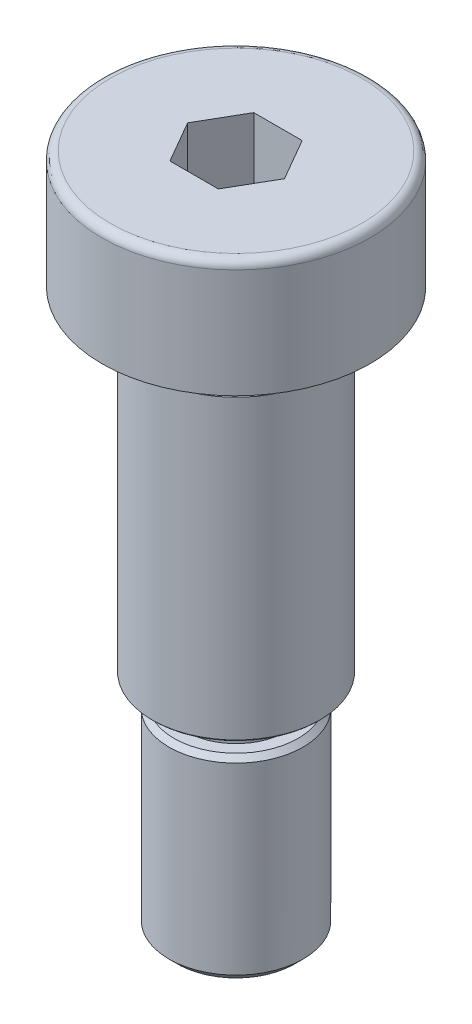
ISO-10303-21;
HEADER;
FILE_DESCRIPTION(('STEP AP214'),'2;1');
FILE_NAME('part.step','',(''),(''),'','','');
FILE_SCHEMA(('AUTOMOTIVE_DESIGN { 1 0 10303 214 1 1 1 1 }'));
ENDSEC;
DATA;
#1=APPLICATION_CONTEXT('core data for automotive mechanical design processes');
#2=APPLICATION_PROTOCOL_DEFINITION('international standard','automotive_design',2000,#1);
#3=PRODUCT_CONTEXT('',#1,'mechanical');
#4=PRODUCT('Part','Part','',(#3));
#5=PRODUCT_RELATED_PRODUCT_CATEGORY('part','',(#4));
#6=PRODUCT_DEFINITION_FORMATION('','',#4);
#7=PRODUCT_DEFINITION_CONTEXT('part definition',#1,'design');
#8=PRODUCT_DEFINITION('design','',#6,#7);
#9=PRODUCT_DEFINITION_SHAPE('','',#8);
#10=(LENGTH_UNIT() NAMED_UNIT(*) SI_UNIT(.MILLI.,.METRE.));
#11=(NAMED_UNIT(*) PLANE_ANGLE_UNIT() SI_UNIT($,.RADIAN.));
#12=(NAMED_UNIT(*) SI_UNIT($,.STERADIAN.) SOLID_ANGLE_UNIT());
#13=UNCERTAINTY_MEASURE_WITH_UNIT(LENGTH_MEASURE(1.E-05),#10,'distance_accuracy_value','');
#14=(GEOMETRIC_REPRESENTATION_CONTEXT(3) GLOBAL_UNCERTAINTY_ASSIGNED_CONTEXT((#13)) GLOBAL_UNIT_ASSIGNED_CONTEXT((#10,
#11,#12)) REPRESENTATION_CONTEXT('',''));
#15=CARTESIAN_POINT('',(0.,0.,0.));
#16=DIRECTION('',(0.,0.,1.));
#17=DIRECTION('',(1.,0.,0.));
#18=AXIS2_PLACEMENT_3D('',#15,#16,#17);
#19=CARTESIAN_POINT('',(-4.00000000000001,0.,0.));
#20=DIRECTION('',(0.,-1.,0.));
#21=DIRECTION('',(0.,0.,-1.));
#22=AXIS2_PLACEMENT_3D('',#19,#20,#21);
#23=PLANE('',#22);
#24=CARTESIAN_POINT('',(0.,0.,0.));
#25=DIRECTION('',(0.,-1.,0.));
#26=DIRECTION('',(0.,0.,-1.));
#27=AXIS2_PLACEMENT_3D('',#24,#25,#26);
#28=CIRCLE('',#27,3.5);
#29=CARTESIAN_POINT('',(0.,0.,-3.5));
#30=VERTEX_POINT('',#29);
#31=EDGE_CURVE('E178',#30,#30,#28,.T.);
#32=ORIENTED_EDGE('',*,*,#31,.T.);
#33=EDGE_LOOP('',(#32));
#34=FACE_BOUND('',#33,.T.);
#35=ADVANCED_FACE('F28',(#34),#23,.T.);
#36=CARTESIAN_POINT('',(0.,50.,0.));
#37=DIRECTION('',(0.,1.,0.));
#38=DIRECTION('',(0.,0.,1.));
#39=AXIS2_PLACEMENT_3D('',#36,#37,#38);
#40=CYLINDRICAL_SURFACE('',#39,4.);
#41=CARTESIAN_POINT('',(0.,11.45,0.));
#42=DIRECTION('',(0.,1.,0.));
#43=DIRECTION('',(0.,0.,1.));
#44=AXIS2_PLACEMENT_3D('',#41,#42,#43);
#45=CIRCLE('',#44,4.);
#46=CARTESIAN_POINT('',(0.,11.45,4.));
#47=VERTEX_POINT('',#46);
#48=EDGE_CURVE('E11',#47,#47,#45,.F.);
#49=ORIENTED_EDGE('',*,*,#48,.T.);
#50=EDGE_LOOP('',(#49));
#51=FACE_BOUND('',#50,.T.);
#52=CARTESIAN_POINT('',(0.,0.500000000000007,0.));
#53=DIRECTION('',(0.,-1.,0.));
#54=DIRECTION('',(0.,0.,-1.));
#55=AXIS2_PLACEMENT_3D('',#52,#53,#54);
#56=CIRCLE('',#55,4.);
#57=CARTESIAN_POINT('',(0.,0.500000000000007,-4.));
#58=VERTEX_POINT('',#57);
#59=EDGE_CURVE('E175',#58,#58,#56,.F.);
#60=ORIENTED_EDGE('',*,*,#59,.T.);
#61=EDGE_LOOP('',(#60));
#62=FACE_BOUND('',#61,.T.);
#63=ADVANCED_FACE('F199',(#51,#62),#40,.T.);
#64=CARTESIAN_POINT('',(-3.,11.75,0.));
#65=DIRECTION('',(0.,1.,0.));
#66=DIRECTION('',(0.,0.,1.));
#67=AXIS2_PLACEMENT_3D('',#64,#65,#66);
#68=PLANE('',#67);
#69=CARTESIAN_POINT('',(0.,11.75,0.));
#70=DIRECTION('',(0.,1.,0.));
#71=DIRECTION('',(0.,0.,1.));
#72=AXIS2_PLACEMENT_3D('',#69,#70,#71);
#73=CIRCLE('',#72,3.69999999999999);
#74=CARTESIAN_POINT('',(0.,11.75,3.69999999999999));
#75=VERTEX_POINT('',#74);
#76=EDGE_CURVE('E35',#75,#75,#73,.T.);
#77=ORIENTED_EDGE('',*,*,#76,.T.);
#78=EDGE_LOOP('',(#77));
#79=FACE_BOUND('',#78,.T.);
#80=CARTESIAN_POINT('',(0.,11.75,0.));
#81=DIRECTION('',(0.,1.,0.));
#82=DIRECTION('',(0.,0.,1.));
#83=AXIS2_PLACEMENT_3D('',#80,#81,#82);
#84=CIRCLE('',#83,3.);
#85=CARTESIAN_POINT('',(0.,11.75,3.));
#86=VERTEX_POINT('',#85);
#87=EDGE_CURVE('E148',#86,#86,#84,.T.);
#88=ORIENTED_EDGE('',*,*,#87,.F.);
#89=EDGE_LOOP('',(#88));
#90=FACE_BOUND('',#89,.T.);
#91=ADVANCED_FACE('F183',(#79,#90),#68,.T.);
#92=CARTESIAN_POINT('',(0.,50.,0.));
#93=DIRECTION('',(0.,1.,0.));
#94=DIRECTION('',(0.,0.,1.));
#95=AXIS2_PLACEMENT_3D('',#92,#93,#94);
#96=CYLINDRICAL_SURFACE('',#95,3.);
#97=CARTESIAN_POINT('',(0.,13.05,0.));
#98=DIRECTION('',(0.,-1.,0.));
#99=DIRECTION('',(0.,0.,-1.));
#100=AXIS2_PLACEMENT_3D('',#97,#98,#99);
#101=CIRCLE('',#100,3.);
#102=CARTESIAN_POINT('',(0.,13.05,-3.));
#103=VERTEX_POINT('',#102);
#104=EDGE_CURVE('E172',#103,#103,#101,.T.);
#105=ORIENTED_EDGE('',*,*,#104,.T.);
#106=EDGE_LOOP('',(#105));
#107=FACE_BOUND('',#106,.T.);
#108=ORIENTED_EDGE('',*,*,#87,.T.);
#109=EDGE_LOOP('',(#108));
#110=FACE_BOUND('',#109,.T.);
#111=ADVANCED_FACE('F212',(#107,#110),#96,.T.);
#112=CARTESIAN_POINT('',(-5.,13.25,0.));
#113=DIRECTION('',(0.,-1.,0.));
#114=DIRECTION('',(0.,0.,-1.));
#115=AXIS2_PLACEMENT_3D('',#112,#113,#114);
#116=PLANE('',#115);
#117=CARTESIAN_POINT('',(0.,13.25,0.));
#118=DIRECTION('',(0.,-1.,0.));
#119=DIRECTION('',(0.,0.,-1.));
#120=AXIS2_PLACEMENT_3D('',#117,#118,#119);
#121=CIRCLE('',#120,3.2);
#122=CARTESIAN_POINT('',(0.,13.25,-3.2));
#123=VERTEX_POINT('',#122);
#124=EDGE_CURVE('E169',#123,#123,#121,.F.);
#125=ORIENTED_EDGE('',*,*,#124,.T.);
#126=EDGE_LOOP('',(#125));
#127=FACE_BOUND('',#126,.T.);
#128=CARTESIAN_POINT('',(0.,13.25,0.));
#129=DIRECTION('',(0.,-1.,0.));
#130=DIRECTION('',(0.,0.,-1.));
#131=AXIS2_PLACEMENT_3D('',#128,#129,#130);
#132=CIRCLE('',#131,4.9);
#133=CARTESIAN_POINT('',(0.,13.25,-4.9));
#134=VERTEX_POINT('',#133);
#135=EDGE_CURVE('E166',#134,#134,#132,.T.);
#136=ORIENTED_EDGE('',*,*,#135,.T.);
#137=EDGE_LOOP('',(#136));
#138=FACE_BOUND('',#137,.T.);
#139=ADVANCED_FACE('F217',(#127,#138),#116,.T.);
#140=CARTESIAN_POINT('',(0.,50.,0.));
#141=DIRECTION('',(0.,1.,0.));
#142=DIRECTION('',(0.,0.,1.));
#143=AXIS2_PLACEMENT_3D('',#140,#141,#142);
#144=CYLINDRICAL_SURFACE('',#143,5.);
#145=CARTESIAN_POINT('',(0.,13.35,0.));
#146=DIRECTION('',(0.,-1.,0.));
#147=DIRECTION('',(0.,0.,-1.));
#148=AXIS2_PLACEMENT_3D('',#145,#146,#147);
#149=CIRCLE('',#148,5.);
#150=CARTESIAN_POINT('',(0.,13.35,-5.));
#151=VERTEX_POINT('',#150);
#152=EDGE_CURVE('E163',#151,#151,#149,.F.);
#153=ORIENTED_EDGE('',*,*,#152,.T.);
#154=EDGE_LOOP('',(#153));
#155=FACE_BOUND('',#154,.T.);
#156=CARTESIAN_POINT('',(0.,31.05,0.));
#157=DIRECTION('',(0.,1.,0.));
#158=DIRECTION('',(0.,0.,1.));
#159=AXIS2_PLACEMENT_3D('',#156,#157,#158);
#160=CIRCLE('',#159,5.);
#161=CARTESIAN_POINT('',(0.,31.05,5.));
#162=VERTEX_POINT('',#161);
#163=EDGE_CURVE('E154',#162,#162,#160,.F.);
#164=ORIENTED_EDGE('',*,*,#163,.T.);
#165=EDGE_LOOP('',(#164));
#166=FACE_BOUND('',#165,.T.);
#167=ADVANCED_FACE('F221',(#155,#166),#144,.T.);
#168=CARTESIAN_POINT('',(-4.,31.25,0.));
#169=DIRECTION('',(0.,1.,0.));
#170=DIRECTION('',(0.,0.,1.));
#171=AXIS2_PLACEMENT_3D('',#168,#169,#170);
#172=PLANE('',#171);
#173=CARTESIAN_POINT('',(0.,31.25,0.));
#174=DIRECTION('',(0.,1.,0.));
#175=DIRECTION('',(0.,0.,1.));
#176=AXIS2_PLACEMENT_3D('',#173,#174,#175);
#177=CIRCLE('',#176,4.8);
#178=CARTESIAN_POINT('',(0.,31.25,4.8));
#179=VERTEX_POINT('',#178);
#180=EDGE_CURVE('E151',#179,#179,#177,.T.);
#181=ORIENTED_EDGE('',*,*,#180,.T.);
#182=EDGE_LOOP('',(#181));
#183=FACE_BOUND('',#182,.T.);
#184=CARTESIAN_POINT('',(0.,31.25,0.));
#185=DIRECTION('',(0.,1.,0.));
#186=DIRECTION('',(0.,0.,1.));
#187=AXIS2_PLACEMENT_3D('',#184,#185,#186);
#188=CIRCLE('',#187,4.);
#189=CARTESIAN_POINT('',(0.,31.25,4.));
#190=VERTEX_POINT('',#189);
#191=EDGE_CURVE('E145',#190,#190,#188,.T.);
#192=ORIENTED_EDGE('',*,*,#191,.F.);
#193=EDGE_LOOP('',(#192));
#194=FACE_BOUND('',#193,.T.);
#195=ADVANCED_FACE('F225',(#183,#194),#172,.T.);
#196=CARTESIAN_POINT('',(0.,50.,0.));
#197=DIRECTION('',(0.,1.,0.));
#198=DIRECTION('',(0.,0.,1.));
#199=AXIS2_PLACEMENT_3D('',#196,#197,#198);
#200=CYLINDRICAL_SURFACE('',#199,4.);
#201=CARTESIAN_POINT('',(0.,33.15,0.));
#202=DIRECTION('',(0.,-1.,0.));
#203=DIRECTION('',(0.,0.,-1.));
#204=AXIS2_PLACEMENT_3D('',#201,#202,#203);
#205=CIRCLE('',#204,4.);
#206=CARTESIAN_POINT('',(0.,33.15,-4.));
#207=VERTEX_POINT('',#206);
#208=EDGE_CURVE('E160',#207,#207,#205,.T.);
#209=ORIENTED_EDGE('',*,*,#208,.T.);
#210=EDGE_LOOP('',(#209));
#211=FACE_BOUND('',#210,.T.);
#212=ORIENTED_EDGE('',*,*,#191,.T.);
#213=EDGE_LOOP('',(#212));
#214=FACE_BOUND('',#213,.T.);
#215=ADVANCED_FACE('F229',(#211,#214),#200,.T.);
#216=CARTESIAN_POINT('',(-8.,33.25,0.));
#217=DIRECTION('',(0.,-1.,0.));
#218=DIRECTION('',(0.,0.,-1.));
#219=AXIS2_PLACEMENT_3D('',#216,#217,#218);
#220=PLANE('',#219);
#221=CARTESIAN_POINT('',(0.,33.25,0.));
#222=DIRECTION('',(0.,-1.,0.));
#223=DIRECTION('',(0.,0.,-1.));
#224=AXIS2_PLACEMENT_3D('',#221,#222,#223);
#225=CIRCLE('',#224,4.1);
#226=CARTESIAN_POINT('',(0.,33.25,-4.1));
#227=VERTEX_POINT('',#226);
#228=EDGE_CURVE('E157',#227,#227,#225,.F.);
#229=ORIENTED_EDGE('',*,*,#228,.T.);
#230=EDGE_LOOP('',(#229));
#231=FACE_BOUND('',#230,.T.);
#232=CARTESIAN_POINT('',(0.,33.25,0.));
#233=DIRECTION('',(0.,1.,0.));
#234=DIRECTION('',(0.,0.,1.));
#235=AXIS2_PLACEMENT_3D('',#232,#233,#234);
#236=CIRCLE('',#235,8.);
#237=CARTESIAN_POINT('',(0.,33.25,8.));
#238=VERTEX_POINT('',#237);
#239=EDGE_CURVE('E142',#238,#238,#236,.T.);
#240=ORIENTED_EDGE('',*,*,#239,.F.);
#241=EDGE_LOOP('',(#240));
#242=FACE_BOUND('',#241,.T.);
#243=ADVANCED_FACE('F233',(#231,#242),#220,.T.);
#244=CARTESIAN_POINT('',(0.,50.,0.));
#245=DIRECTION('',(0.,1.,0.));
#246=DIRECTION('',(0.,0.,1.));
#247=AXIS2_PLACEMENT_3D('',#244,#245,#246);
#248=CYLINDRICAL_SURFACE('',#247,8.);
#249=ORIENTED_EDGE('',*,*,#239,.T.);
#250=EDGE_LOOP('',(#249));
#251=FACE_BOUND('',#250,.T.);
#252=CARTESIAN_POINT('',(0.,39.75,0.));
#253=DIRECTION('',(0.,1.,0.));
#254=DIRECTION('',(0.,0.,1.));
#255=AXIS2_PLACEMENT_3D('',#252,#253,#254);
#256=CIRCLE('',#255,8.);
#257=CARTESIAN_POINT('',(0.,39.75,8.));
#258=VERTEX_POINT('',#257);
#259=EDGE_CURVE('E139',#258,#258,#256,.T.);
#260=ORIENTED_EDGE('',*,*,#259,.F.);
#261=EDGE_LOOP('',(#260));
#262=FACE_BOUND('',#261,.T.);
#263=ADVANCED_FACE('F237',(#251,#262),#248,.T.);
#264=CARTESIAN_POINT('',(0.,39.75,0.));
#265=DIRECTION('',(0.,1.,0.));
#266=DIRECTION('',(0.,0.,1.));
#267=AXIS2_PLACEMENT_3D('',#264,#265,#266);
#268=TOROIDAL_SURFACE('',#267,7.5,0.5);
#269=CARTESIAN_POINT('',(0.,40.25,0.));
#270=DIRECTION('',(0.,1.,0.));
#271=DIRECTION('',(0.,0.,1.));
#272=AXIS2_PLACEMENT_3D('',#269,#270,#271);
#273=CIRCLE('',#272,7.5);
#274=CARTESIAN_POINT('',(0.,40.25,7.5));
#275=VERTEX_POINT('',#274);
#276=EDGE_CURVE('E130',#275,#275,#273,.T.);
#277=ORIENTED_EDGE('',*,*,#276,.F.);
#278=EDGE_LOOP('',(#277));
#279=FACE_BOUND('',#278,.T.);
#280=ORIENTED_EDGE('',*,*,#259,.T.);
#281=EDGE_LOOP('',(#280));
#282=FACE_BOUND('',#281,.T.);
#283=ADVANCED_FACE('F241',(#279,#282),#268,.T.);
#284=CARTESIAN_POINT('',(0.,40.25,0.));
#285=DIRECTION('',(0.,1.,0.));
#286=DIRECTION('',(0.,0.,1.));
#287=AXIS2_PLACEMENT_3D('',#284,#285,#286);
#288=PLANE('',#287);
#289=DIRECTION('',(-0.5,0.,0.866025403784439));
#290=VECTOR('',#289,1.);
#291=CARTESIAN_POINT('',(-1.44337567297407,40.25,-2.5));
#292=LINE('',#291,#290);
#293=CARTESIAN_POINT('',(-1.44337567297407,40.25,-2.5));
#294=VERTEX_POINT('',#293);
#295=CARTESIAN_POINT('',(-2.88675134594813,40.25,0.));
#296=VERTEX_POINT('',#295);
#297=EDGE_CURVE('E42',#294,#296,#292,.T.);
#298=ORIENTED_EDGE('',*,*,#297,.F.);
#299=DIRECTION('',(-1.,0.,0.));
#300=VECTOR('',#299,1.);
#301=CARTESIAN_POINT('',(1.44337567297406,40.25,-2.5));
#302=LINE('',#301,#300);
#303=CARTESIAN_POINT('',(1.44337567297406,40.25,-2.5));
#304=VERTEX_POINT('',#303);
#305=EDGE_CURVE('E112',#304,#294,#302,.T.);
#306=ORIENTED_EDGE('',*,*,#305,.F.);
#307=DIRECTION('',(-0.5,0.,-0.866025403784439));
#308=VECTOR('',#307,1.);
#309=CARTESIAN_POINT('',(2.88675134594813,40.25,0.));
#310=LINE('',#309,#308);
#311=CARTESIAN_POINT('',(2.88675134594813,40.25,0.));
#312=VERTEX_POINT('',#311);
#313=EDGE_CURVE('E106',#312,#304,#310,.T.);
#314=ORIENTED_EDGE('',*,*,#313,.F.);
#315=DIRECTION('',(0.5,0.,-0.866025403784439));
#316=VECTOR('',#315,1.);
#317=CARTESIAN_POINT('',(1.44337567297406,40.25,2.5));
#318=LINE('',#317,#316);
#319=CARTESIAN_POINT('',(1.44337567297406,40.25,2.5));
#320=VERTEX_POINT('',#319);
#321=EDGE_CURVE('E104',#320,#312,#318,.T.);
#322=ORIENTED_EDGE('',*,*,#321,.F.);
#323=DIRECTION('',(1.,0.,0.));
#324=VECTOR('',#323,1.);
#325=CARTESIAN_POINT('',(-1.44337567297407,40.25,2.5));
#326=LINE('',#325,#324);
#327=CARTESIAN_POINT('',(-1.44337567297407,40.25,2.5));
#328=VERTEX_POINT('',#327);
#329=EDGE_CURVE('E85',#328,#320,#326,.T.);
#330=ORIENTED_EDGE('',*,*,#329,.F.);
#331=DIRECTION('',(0.5,0.,0.866025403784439));
#332=VECTOR('',#331,1.);
#333=CARTESIAN_POINT('',(-2.88675134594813,40.25,0.));
#334=LINE('',#333,#332);
#335=EDGE_CURVE('E96',#296,#328,#334,.T.);
#336=ORIENTED_EDGE('',*,*,#335,.F.);
#337=EDGE_LOOP('',(#298,#306,#314,#322,#330,#336));
#338=FACE_BOUND('',#337,.T.);
#339=ORIENTED_EDGE('',*,*,#276,.T.);
#340=EDGE_LOOP('',(#339));
#341=FACE_BOUND('',#340,.T.);
#342=ADVANCED_FACE('F100',(#338,#341),#288,.T.);
#343=CARTESIAN_POINT('',(-1.44337567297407,35.25,-2.5));
#344=DIRECTION('',(-0.866025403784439,0.,-0.5));
#345=DIRECTION('',(-0.5,0.,0.866025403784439));
#346=AXIS2_PLACEMENT_3D('',#343,#344,#345);
#347=PLANE('',#346);
#348=ORIENTED_EDGE('',*,*,#297,.T.);
#349=DIRECTION('',(0.,1.,0.));
#350=VECTOR('',#349,1.);
#351=CARTESIAN_POINT('',(-2.88675134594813,35.25,0.));
#352=LINE('',#351,#350);
#353=CARTESIAN_POINT('',(-2.88675134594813,35.25,0.));
#354=VERTEX_POINT('',#353);
#355=EDGE_CURVE('E93',#354,#296,#352,.T.);
#356=ORIENTED_EDGE('',*,*,#355,.F.);
#357=DIRECTION('',(-0.5,0.,0.866025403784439));
#358=VECTOR('',#357,1.);
#359=CARTESIAN_POINT('',(-1.44337567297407,35.25,-2.5));
#360=LINE('',#359,#358);
#361=CARTESIAN_POINT('',(-1.44337567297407,35.25,-2.5));
#362=VERTEX_POINT('',#361);
#363=EDGE_CURVE('E114',#362,#354,#360,.T.);
#364=ORIENTED_EDGE('',*,*,#363,.F.);
#365=DIRECTION('',(0.,1.,0.));
#366=VECTOR('',#365,1.);
#367=CARTESIAN_POINT('',(-1.44337567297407,35.25,-2.5));
#368=LINE('',#367,#366);
#369=EDGE_CURVE('E49',#362,#294,#368,.T.);
#370=ORIENTED_EDGE('',*,*,#369,.T.);
#371=EDGE_LOOP('',(#348,#356,#364,#370));
#372=FACE_BOUND('',#371,.T.);
#373=ADVANCED_FACE('F248',(#372),#347,.F.);
#374=CARTESIAN_POINT('',(1.44337567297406,35.25,-2.5));
#375=DIRECTION('',(0.,0.,-1.));
#376=DIRECTION('',(-1.,0.,0.));
#377=AXIS2_PLACEMENT_3D('',#374,#375,#376);
#378=PLANE('',#377);
#379=ORIENTED_EDGE('',*,*,#305,.T.);
#380=ORIENTED_EDGE('',*,*,#369,.F.);
#381=DIRECTION('',(-1.,0.,0.));
#382=VECTOR('',#381,1.);
#383=CARTESIAN_POINT('',(1.44337567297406,35.25,-2.5));
#384=LINE('',#383,#382);
#385=CARTESIAN_POINT('',(1.44337567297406,35.25,-2.5));
#386=VERTEX_POINT('',#385);
#387=EDGE_CURVE('E126',#386,#362,#384,.T.);
#388=ORIENTED_EDGE('',*,*,#387,.F.);
#389=DIRECTION('',(0.,1.,0.));
#390=VECTOR('',#389,1.);
#391=CARTESIAN_POINT('',(1.44337567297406,35.25,-2.5));
#392=LINE('',#391,#390);
#393=EDGE_CURVE('E131',#386,#304,#392,.T.);
#394=ORIENTED_EDGE('',*,*,#393,.T.);
#395=EDGE_LOOP('',(#379,#380,#388,#394));
#396=FACE_BOUND('',#395,.T.);
#397=ADVANCED_FACE('F251',(#396),#378,.F.);
#398=CARTESIAN_POINT('',(2.88675134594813,35.25,0.));
#399=DIRECTION('',(0.866025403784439,0.,-0.5));
#400=DIRECTION('',(-0.5,0.,-0.866025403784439));
#401=AXIS2_PLACEMENT_3D('',#398,#399,#400);
#402=PLANE('',#401);
#403=ORIENTED_EDGE('',*,*,#313,.T.);
#404=ORIENTED_EDGE('',*,*,#393,.F.);
#405=DIRECTION('',(-0.5,0.,-0.866025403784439));
#406=VECTOR('',#405,1.);
#407=CARTESIAN_POINT('',(2.88675134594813,35.25,0.));
#408=LINE('',#407,#406);
#409=CARTESIAN_POINT('',(2.88675134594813,35.25,0.));
#410=VERTEX_POINT('',#409);
#411=EDGE_CURVE('E123',#410,#386,#408,.T.);
#412=ORIENTED_EDGE('',*,*,#411,.F.);
#413=DIRECTION('',(0.,1.,0.));
#414=VECTOR('',#413,1.);
#415=CARTESIAN_POINT('',(2.88675134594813,35.25,0.));
#416=LINE('',#415,#414);
#417=EDGE_CURVE('E133',#410,#312,#416,.T.);
#418=ORIENTED_EDGE('',*,*,#417,.T.);
#419=EDGE_LOOP('',(#403,#404,#412,#418));
#420=FACE_BOUND('',#419,.T.);
#421=ADVANCED_FACE('F260',(#420),#402,.F.);
#422=CARTESIAN_POINT('',(1.44337567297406,35.25,2.5));
#423=DIRECTION('',(0.866025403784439,0.,0.5));
#424=DIRECTION('',(0.5,0.,-0.866025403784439));
#425=AXIS2_PLACEMENT_3D('',#422,#423,#424);
#426=PLANE('',#425);
#427=ORIENTED_EDGE('',*,*,#321,.T.);
#428=ORIENTED_EDGE('',*,*,#417,.F.);
#429=DIRECTION('',(0.5,0.,-0.866025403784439));
#430=VECTOR('',#429,1.);
#431=CARTESIAN_POINT('',(1.44337567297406,35.25,2.5));
#432=LINE('',#431,#430);
#433=CARTESIAN_POINT('',(1.44337567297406,35.25,2.5));
#434=VERTEX_POINT('',#433);
#435=EDGE_CURVE('E120',#434,#410,#432,.T.);
#436=ORIENTED_EDGE('',*,*,#435,.F.);
#437=DIRECTION('',(0.,1.,0.));
#438=VECTOR('',#437,1.);
#439=CARTESIAN_POINT('',(1.44337567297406,35.25,2.5));
#440=LINE('',#439,#438);
#441=EDGE_CURVE('E92',#434,#320,#440,.T.);
#442=ORIENTED_EDGE('',*,*,#441,.T.);
#443=EDGE_LOOP('',(#427,#428,#436,#442));
#444=FACE_BOUND('',#443,.T.);
#445=ADVANCED_FACE('F257',(#444),#426,.F.);
#446=CARTESIAN_POINT('',(-1.44337567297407,35.25,2.5));
#447=DIRECTION('',(0.,0.,1.));
#448=DIRECTION('',(1.,0.,0.));
#449=AXIS2_PLACEMENT_3D('',#446,#447,#448);
#450=PLANE('',#449);
#451=ORIENTED_EDGE('',*,*,#329,.T.);
#452=ORIENTED_EDGE('',*,*,#441,.F.);
#453=DIRECTION('',(1.,0.,0.));
#454=VECTOR('',#453,1.);
#455=CARTESIAN_POINT('',(-1.44337567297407,35.25,2.5));
#456=LINE('',#455,#454);
#457=CARTESIAN_POINT('',(-1.44337567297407,35.25,2.5));
#458=VERTEX_POINT('',#457);
#459=EDGE_CURVE('E88',#458,#434,#456,.T.);
#460=ORIENTED_EDGE('',*,*,#459,.F.);
#461=DIRECTION('',(0.,1.,0.));
#462=VECTOR('',#461,1.);
#463=CARTESIAN_POINT('',(-1.44337567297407,35.25,2.5));
#464=LINE('',#463,#462);
#465=EDGE_CURVE('E81',#458,#328,#464,.T.);
#466=ORIENTED_EDGE('',*,*,#465,.T.);
#467=EDGE_LOOP('',(#451,#452,#460,#466));
#468=FACE_BOUND('',#467,.T.);
#469=ADVANCED_FACE('F83',(#468),#450,.F.);
#470=CARTESIAN_POINT('',(-2.88675134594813,35.25,0.));
#471=DIRECTION('',(-0.866025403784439,0.,0.5));
#472=DIRECTION('',(0.5,0.,0.866025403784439));
#473=AXIS2_PLACEMENT_3D('',#470,#471,#472);
#474=PLANE('',#473);
#475=ORIENTED_EDGE('',*,*,#335,.T.);
#476=ORIENTED_EDGE('',*,*,#465,.F.);
#477=DIRECTION('',(0.5,0.,0.866025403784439));
#478=VECTOR('',#477,1.);
#479=CARTESIAN_POINT('',(-2.88675134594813,35.25,0.));
#480=LINE('',#479,#478);
#481=EDGE_CURVE('E117',#354,#458,#480,.T.);
#482=ORIENTED_EDGE('',*,*,#481,.F.);
#483=ORIENTED_EDGE('',*,*,#355,.T.);
#484=EDGE_LOOP('',(#475,#476,#482,#483));
#485=FACE_BOUND('',#484,.T.);
#486=ADVANCED_FACE('F97',(#485),#474,.F.);
#487=CARTESIAN_POINT('',(-1.44337567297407,35.25,-2.5));
#488=DIRECTION('',(0.,-1.,0.));
#489=DIRECTION('',(0.,0.,-1.));
#490=AXIS2_PLACEMENT_3D('',#487,#488,#489);
#491=PLANE('',#490);
#492=ORIENTED_EDGE('',*,*,#363,.T.);
#493=ORIENTED_EDGE('',*,*,#481,.T.);
#494=ORIENTED_EDGE('',*,*,#459,.T.);
#495=ORIENTED_EDGE('',*,*,#435,.T.);
#496=ORIENTED_EDGE('',*,*,#411,.T.);
#497=ORIENTED_EDGE('',*,*,#387,.T.);
#498=EDGE_LOOP('',(#492,#493,#494,#495,#496,#497));
#499=FACE_BOUND('',#498,.T.);
#500=ADVANCED_FACE('F254',(#499),#491,.F.);
#501=CARTESIAN_POINT('',(0.,31.25,0.));
#502=DIRECTION('',(0.,-1.,0.));
#503=DIRECTION('',(0.,0.,-1.));
#504=AXIS2_PLACEMENT_3D('',#501,#502,#503);
#505=CONICAL_SURFACE('',#504,4.8,0.78539816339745);
#506=ORIENTED_EDGE('',*,*,#163,.F.);
#507=EDGE_LOOP('',(#506));
#508=FACE_BOUND('',#507,.T.);
#509=ORIENTED_EDGE('',*,*,#180,.F.);
#510=EDGE_LOOP('',(#509));
#511=FACE_BOUND('',#510,.T.);
#512=ADVANCED_FACE('F269',(#508,#511),#505,.T.);
#513=CARTESIAN_POINT('',(0.,33.15,0.));
#514=DIRECTION('',(0.,-1.,0.));
#515=DIRECTION('',(0.,0.,-1.));
#516=AXIS2_PLACEMENT_3D('',#513,#514,#515);
#517=TOROIDAL_SURFACE('',#516,4.1,0.1);
#518=ORIENTED_EDGE('',*,*,#208,.F.);
#519=EDGE_LOOP('',(#518));
#520=FACE_BOUND('',#519,.T.);
#521=ORIENTED_EDGE('',*,*,#228,.F.);
#522=EDGE_LOOP('',(#521));
#523=FACE_BOUND('',#522,.T.);
#524=ADVANCED_FACE('F273',(#520,#523),#517,.F.);
#525=CARTESIAN_POINT('',(0.,13.35,0.));
#526=DIRECTION('',(0.,1.,0.));
#527=DIRECTION('',(0.,0.,1.));
#528=AXIS2_PLACEMENT_3D('',#525,#526,#527);
#529=CONICAL_SURFACE('',#528,5.,0.78539816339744);
#530=ORIENTED_EDGE('',*,*,#135,.F.);
#531=EDGE_LOOP('',(#530));
#532=FACE_BOUND('',#531,.T.);
#533=ORIENTED_EDGE('',*,*,#152,.F.);
#534=EDGE_LOOP('',(#533));
#535=FACE_BOUND('',#534,.T.);
#536=ADVANCED_FACE('F277',(#532,#535),#529,.T.);
#537=CARTESIAN_POINT('',(0.,13.05,0.));
#538=DIRECTION('',(0.,-1.,0.));
#539=DIRECTION('',(0.,0.,-1.));
#540=AXIS2_PLACEMENT_3D('',#537,#538,#539);
#541=TOROIDAL_SURFACE('',#540,3.2,0.2);
#542=ORIENTED_EDGE('',*,*,#104,.F.);
#543=EDGE_LOOP('',(#542));
#544=FACE_BOUND('',#543,.T.);
#545=ORIENTED_EDGE('',*,*,#124,.F.);
#546=EDGE_LOOP('',(#545));
#547=FACE_BOUND('',#546,.T.);
#548=ADVANCED_FACE('F194',(#544,#547),#541,.F.);
#549=CARTESIAN_POINT('',(0.,0.500000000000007,0.));
#550=DIRECTION('',(0.,1.,0.));
#551=DIRECTION('',(0.,0.,1.));
#552=AXIS2_PLACEMENT_3D('',#549,#550,#551);
#553=CONICAL_SURFACE('',#552,4.,0.785398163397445);
#554=ORIENTED_EDGE('',*,*,#31,.F.);
#555=EDGE_LOOP('',(#554));
#556=FACE_BOUND('',#555,.T.);
#557=ORIENTED_EDGE('',*,*,#59,.F.);
#558=EDGE_LOOP('',(#557));
#559=FACE_BOUND('',#558,.T.);
#560=ADVANCED_FACE('F188',(#556,#559),#553,.T.);
#561=CARTESIAN_POINT('',(0.,11.75,0.));
#562=DIRECTION('',(0.,-1.,0.));
#563=DIRECTION('',(0.,0.,-1.));
#564=AXIS2_PLACEMENT_3D('',#561,#562,#563);
#565=CONICAL_SURFACE('',#564,3.7,0.785398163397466);
#566=ORIENTED_EDGE('',*,*,#48,.F.);
#567=EDGE_LOOP('',(#566));
#568=FACE_BOUND('',#567,.T.);
#569=ORIENTED_EDGE('',*,*,#76,.F.);
#570=EDGE_LOOP('',(#569));
#571=FACE_BOUND('',#570,.T.);
#572=ADVANCED_FACE('F186',(#568,#571),#565,.T.);
#573=CLOSED_SHELL('',(#35,#63,#91,#111,#139,#167,#195,#215,#243,#263,#283,#342,#373,#397,#421,
#445,#469,#486,#500,#512,#524,#536,#548,#560,#572));
#574=MANIFOLD_SOLID_BREP('B2',#573);
#575=ADVANCED_BREP_SHAPE_REPRESENTATION('',(#18,#574),#14);
#576=SHAPE_DEFINITION_REPRESENTATION(#9,#575);
ENDSEC;
END-ISO-10303-21;
